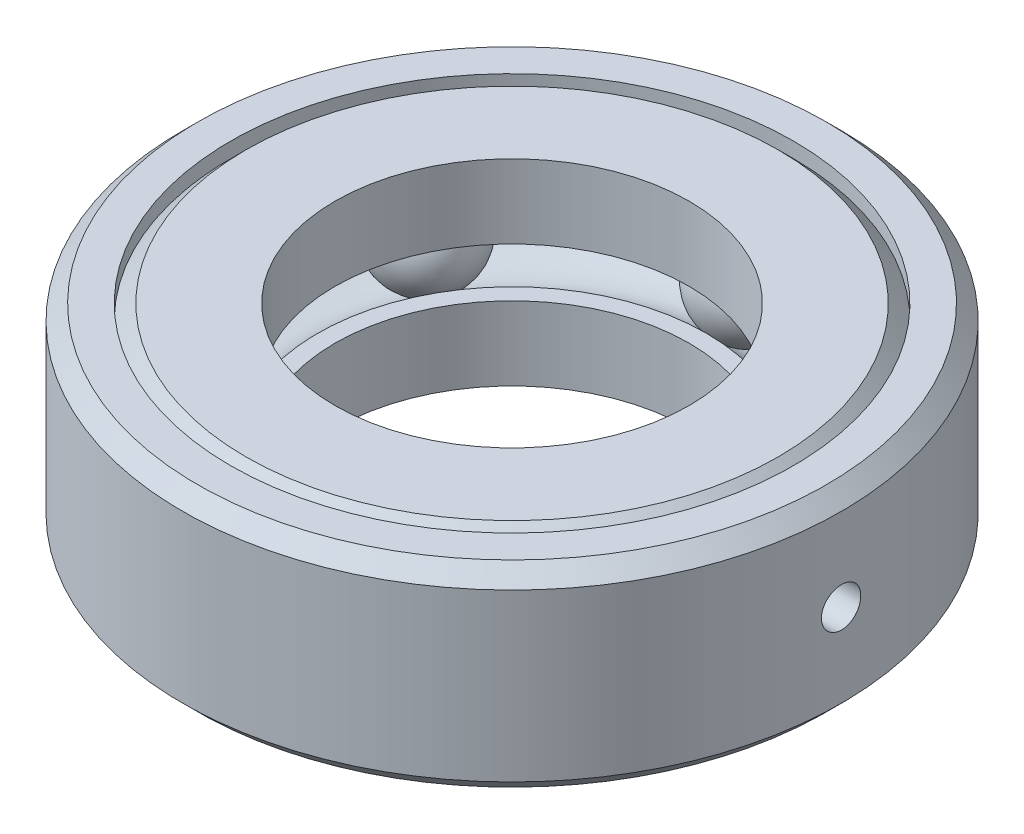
from build123d import *

# Parameters (mm, degrees)
CIRPATTERN1_COUNT  = 6
CIRPATTERN1_ANGLE  = 300
SKETCH5_R          = 1.5875
CUT_EXTRUDE1_DEPTH = 39.433404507


with BuildPart() as part:
    # Sketch1 → Revolve1 (revolve)
    with BuildSketch(Plane(origin=(0, 0, 0), x_dir=(0, 0, -1), z_dir=(1, 0, 0)), mode=Mode.PRIVATE) as revolve1_sk:
        with BuildLine():
            Line((-21.465697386, 7.9375), (-14.2875, 7.9375))
            Line((-14.2875, 7.9375), (-14.2875, 1.984375))
            Line((-14.2875, 1.984375), (-15.672492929, 1.984375))
            ThreePointArc((-15.672492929, 1.984375), (-19.10953125, 3.96875), (-22.546569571, 1.984375))
            Line((-22.546569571, 1.984375), (-23.9315625, 1.984375))
            Line((-23.9315625, 1.984375), (-23.9315625, 5.471634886))
            Line((-23.9315625, 5.471634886), (-21.465697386, 7.9375))
        make_face()
        with BuildLine():
            Line((-14.2875, -7.9375), (-14.2875, -1.984375))
            Line((-14.2875, -1.984375), (-15.672492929, -1.984375))
            ThreePointArc((-15.672492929, -1.984375), (-19.10953125, -3.96875), (-22.546569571, -1.984375))
            Line((-22.546569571, -1.984375), (-23.9315625, -1.984375))
            Line((-23.9315625, -1.984375), (-23.9315625, -5.471634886))
            Line((-23.9315625, -5.471634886), (-21.465697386, -7.9375))
            Line((-21.465697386, -7.9375), (-14.2875, -7.9375))
        make_face()
    revolve(revolve1_sk.sketch.rotate(Axis((0, -7.9375, 0), (0, 1, 0)), 180), axis=Axis((0, -7.9375, 0), (0, 1, 0)))


with BuildPart() as body_2:
    # Sketch3 → Revolve2 (revolve)
    with BuildSketch(Plane(origin=(0, 0, 0), x_dir=(0, 0, -1), z_dir=(1, 0, 0))):
        with BuildLine():
            Line((-19.10953125, 3.96875), (-19.10953125, -3.96875))
            ThreePointArc((-19.10953125, -3.96875), (-23.07828125, 0), (-19.10953125, 3.96875))
        make_face()
    revolve(axis=Axis((0, 3.96875, 19.10953125), (0, -1, 0)))


with BuildPart() as cirpattern1_1:
    # CirPattern1: pattern copy
    add(body_2.part.rotate(Axis((0, 7.9375, 0), (0, -1, 0)), 1 * CIRPATTERN1_ANGLE / (CIRPATTERN1_COUNT - 1)))


with BuildPart() as cirpattern1_2:
    # CirPattern1: pattern copy
    add(body_2.part.rotate(Axis((0, 7.9375, 0), (0, -1, 0)), 2 * CIRPATTERN1_ANGLE / (CIRPATTERN1_COUNT - 1)))


with BuildPart() as cirpattern1_3:
    # CirPattern1: pattern copy
    add(body_2.part.rotate(Axis((0, 7.9375, 0), (0, -1, 0)), 3 * CIRPATTERN1_ANGLE / (CIRPATTERN1_COUNT - 1)))


with BuildPart() as cirpattern1_4:
    # CirPattern1: pattern copy
    add(body_2.part.rotate(Axis((0, 7.9375, 0), (0, -1, 0)), 4 * CIRPATTERN1_ANGLE / (CIRPATTERN1_COUNT - 1)))


with BuildPart() as cirpattern1_5:
    # CirPattern1: pattern copy
    add(body_2.part.rotate(Axis((0, 7.9375, 0), (0, -1, 0)), 5 * CIRPATTERN1_ANGLE / (CIRPATTERN1_COUNT - 1)))


with BuildPart() as body_8:
    # Sketch4 → Revolve3 (revolve)
    with BuildSketch(Plane(origin=(0, 0, 0), x_dir=(0, 0, -1), z_dir=(1, 0, 0)), mode=Mode.PRIVATE) as revolve3_sk:
        Polygon((-22.698629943, 7.9375), (-25.357692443, 7.9375), (-26.590625, 6.704567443), (-26.590625, -6.704567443), (-25.357692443, -7.9375), (-22.698629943, -7.9375), (-22.698629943, -6.704567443), (-23.9315625, -5.471634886), (-23.9315625, 5.471634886), (-22.698629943, 6.704567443), align=None)
    revolve(revolve3_sk.sketch.rotate(Axis((0, -7.9375, 0), (0, 1, 0)), 180), axis=Axis((0, -7.9375, 0), (0, 1, 0)))

    # Sketch5 → Cut-Extrude1 (cut, through all)
    with BuildSketch(Plane(origin=(0, 0, 0), x_dir=(0, 0, -1), z_dir=(1, 0, 0))):
        with Locations(Location((0, 0, 0), (0, 0, 180))):
            Circle(SKETCH5_R)
    extrude(amount=CUT_EXTRUDE1_DEPTH, mode=Mode.SUBTRACT)


solid = Compound([part.part, body_2.part, cirpattern1_1.part, cirpattern1_2.part, cirpattern1_3.part, cirpattern1_4.part, cirpattern1_5.part, body_8.part])
